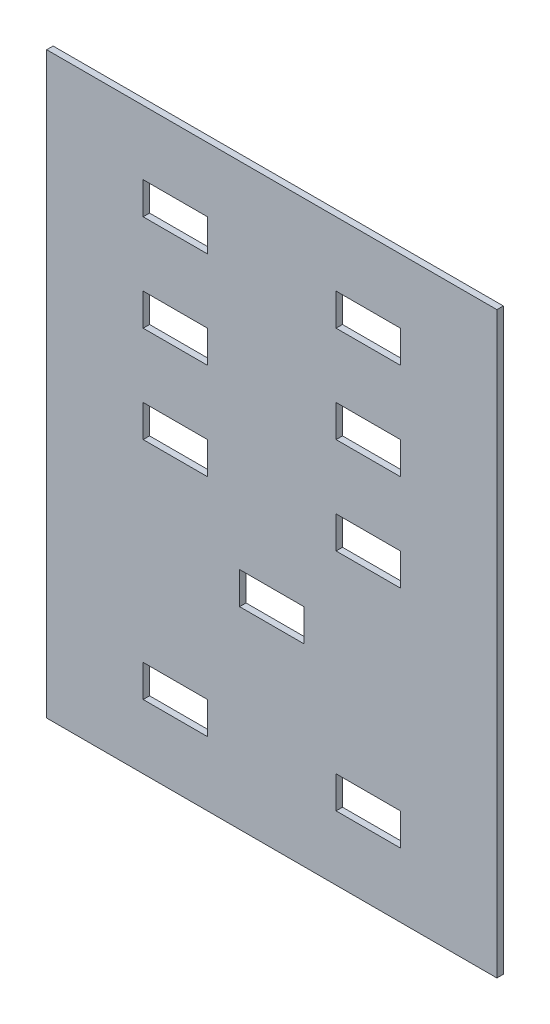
from build123d import *

# Parameters (mm, degrees)
SKETCH1_W           = 350
SKETCH1_H           = 450
BOSS_EXTRUDE1_DEPTH = 5
SKETCH2_W           = 50
SKETCH2_H           = 25
CUT_EXTRUDE1_DEPTH  = 571.109638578


with BuildPart() as part:
    # Sketch1 → Boss-Extrude1 (new body)
    with BuildSketch(Plane.XY):
        with Locations((175, 225)):
            Rectangle(SKETCH1_W, SKETCH1_H)
    extrude(amount=BOSS_EXTRUDE1_DEPTH)

    # Sketch2 → Cut-Extrude1 (cut, through all)
    with BuildSketch(Plane.XY.offset(5)):
        with Locations((100, 387.5)):
            Rectangle(SKETCH2_W, SKETCH2_H)
    cut_extrude1 = extrude(amount=-CUT_EXTRUDE1_DEPTH, mode=Mode.SUBTRACT)

    # Sketch-Pattern1: Cut-Extrude1 at 8 more places
    with Locations((150, 0, 0), (150, -75, 0), (0, -75, 0), (0, -150, 0), (150, -150, 0), (75, -225, 0), (0, -325, 0), (150, -325, 0)):
        add(cut_extrude1, mode=Mode.SUBTRACT)


solid = part.part
